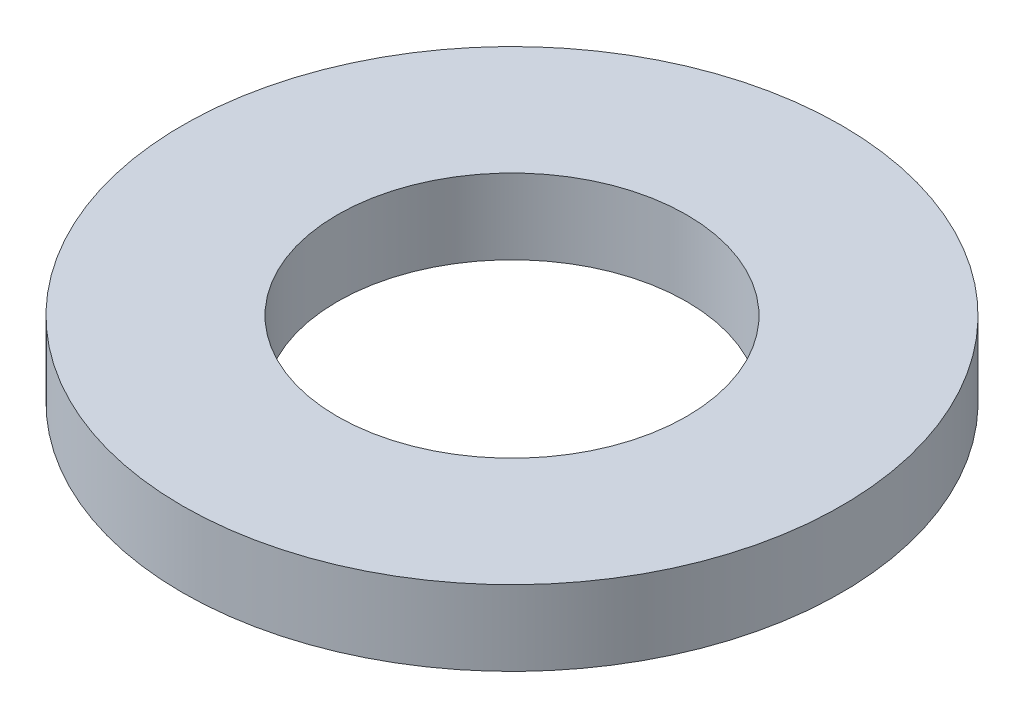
from build123d import *

# Parameters (mm, degrees)
SKETCH1_R           = 6.35
SKETCH1_R_2         = 3.3655
BOSS_EXTRUDE1_DEPTH = 1.4478


with BuildPart() as part:
    # Sketch1 → Boss-Extrude1 (new body)
    with BuildSketch(Plane(origin=(0, 0, 0), x_dir=(1, 0, 0), z_dir=(0, 1, 0))):
        with Locations(Location((0, 0, 0), (0, 0, 270))):
            Circle(SKETCH1_R)
        with Locations(Location((0, 0, 0), (0, 0, 270))):
            Circle(SKETCH1_R_2, mode=Mode.SUBTRACT)
    extrude(amount=BOSS_EXTRUDE1_DEPTH)


solid = part.part
